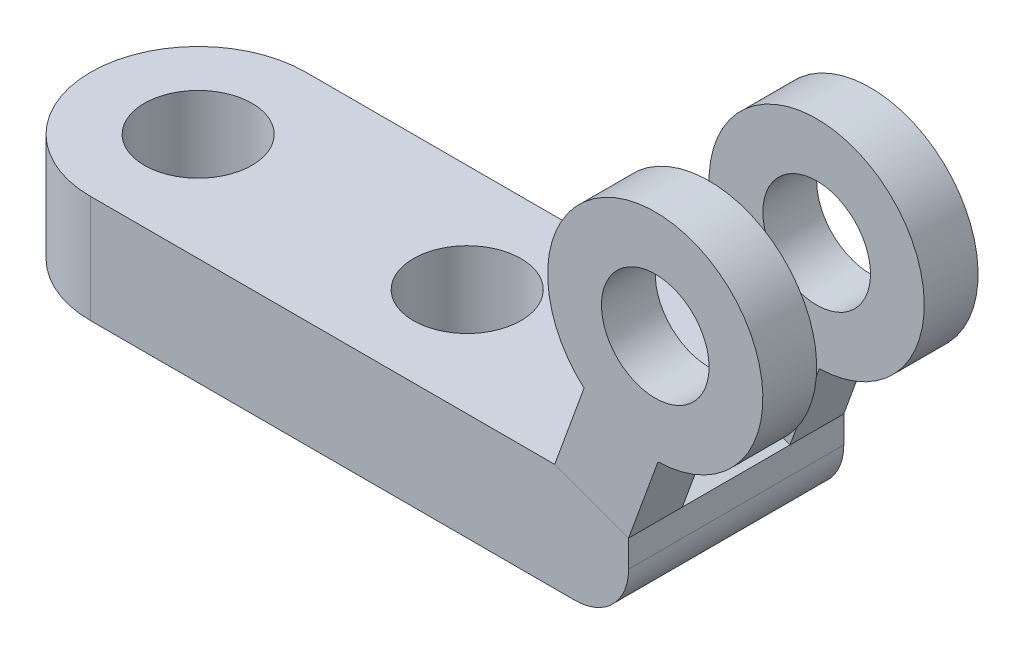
from build123d import *

# Parameters (mm, degrees)
SKETCH1_R           = 0.5
SKETCH1_R_2         = 1
BOSS_EXTRUDE1_DEPTH = 1
FILLET1_R           = 0.5
CUT_EXTRUDE1_DEPTH  = 2
SKETCH3_R           = 0.5
BOSS_EXTRUDE2_DEPTH = 0.5
BOSS_EXTRUDE3_START = -2
SKETCH3_4_R         = 0.5
BOSS_EXTRUDE3_DEPTH = 0.5


with BuildPart() as part:
    # Sketch1 → Boss-Extrude1 (new body)
    # profile 1 of 2: a face of its own
    with BuildSketch(Plane(origin=(0, 0, 0), x_dir=(1, 0, 0), z_dir=(0, 1, 0))):
        with BuildLine():
            Line((5, 1), (0, 1))
            ThreePointArc((0, 1), (0.707106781, 0.707106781), (1, 0))
            ThreePointArc((1, 0), (0.707106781, -0.707106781), (0, -1))
            Line((0, -1), (5, -1))
            Line((5, -1), (5, 1))
        make_face()
        with Locations(Location((2.5, 0, 0), (0, 0, 270))):
            Circle(SKETCH1_R, mode=Mode.SUBTRACT)
    # profile 2 of 2: a face of its own
    with BuildSketch(Plane(origin=(0, 0, 0), x_dir=(1, 0, 0), z_dir=(0, 1, 0))):
        Circle(SKETCH1_R_2)
        with Locations(Location((0, 0, 0), (0, 0, 270))):
            Circle(SKETCH1_R, mode=Mode.SUBTRACT)
    extrude(amount=BOSS_EXTRUDE1_DEPTH)

    # Fillet1
    fillet1_edges = [part.edges().sort_by_distance(p)[0] for p in [
        (5, 0, 0),
    ]]
    fillet(fillet1_edges, radius=FILLET1_R)

    # Sketch2 → Cut-Extrude1 (cut)
    with BuildSketch(Plane.XY.offset(1)):
        Polygon((5, 0.75), (4.313130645, 1), (5, 1), align=None)
    extrude(amount=-CUT_EXTRUDE1_DEPTH, mode=Mode.SUBTRACT)

    # Sketch3_4 → Boss-Extrude3 (add)
    with BuildSketch(Plane.XY.offset(1).offset(BOSS_EXTRUDE3_START)):
        with BuildLine():
            Line((4.586108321, 1.75), (4.313130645, 1))
            Line((4.313130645, 1), (5, 0.75))
            Line((5, 0.75), (5.272977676, 1.5))
            ThreePointArc((5.272977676, 1.5), (5.589922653, 3.439378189), (4.586108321, 1.75))
        make_face()
        with Locations((5.24790251, 2.499685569)):
            Circle(SKETCH3_4_R, mode=Mode.SUBTRACT)
    extrude(amount=BOSS_EXTRUDE3_DEPTH)


with BuildPart() as body_2:
    # Sketch3 → Boss-Extrude2 (new body)
    with BuildSketch(Plane.XY.offset(1)):
        with BuildLine():
            Line((4.586108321, 1.75), (4.313130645, 1))
            Line((4.313130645, 1), (5, 0.75))
            Line((5, 0.75), (5.272977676, 1.5))
            ThreePointArc((5.272977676, 1.5), (5.589922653, 3.439378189), (4.586108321, 1.75))
        make_face()
        with Locations((5.24790251, 2.499685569)):
            Circle(SKETCH3_R, mode=Mode.SUBTRACT)
    extrude(amount=-BOSS_EXTRUDE2_DEPTH)


solid = Compound([part.part, body_2.part])
